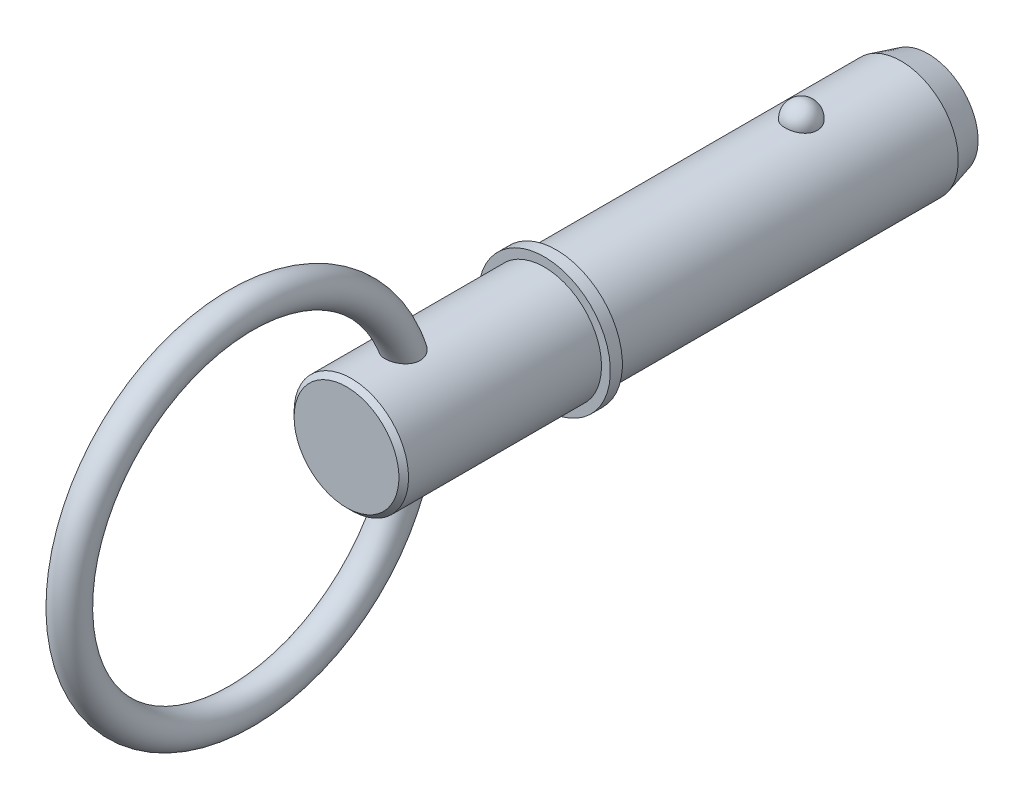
ISO-10303-21;
HEADER;
FILE_DESCRIPTION(('STEP AP214'),'2;1');
FILE_NAME('part.step','',(''),(''),'','','');
FILE_SCHEMA(('AUTOMOTIVE_DESIGN { 1 0 10303 214 1 1 1 1 }'));
ENDSEC;
DATA;
#1=APPLICATION_CONTEXT('core data for automotive mechanical design processes');
#2=APPLICATION_PROTOCOL_DEFINITION('international standard','automotive_design',2000,#1);
#3=PRODUCT_CONTEXT('',#1,'mechanical');
#4=PRODUCT('Part','Part','',(#3));
#5=PRODUCT_RELATED_PRODUCT_CATEGORY('part','',(#4));
#6=PRODUCT_DEFINITION_FORMATION('','',#4);
#7=PRODUCT_DEFINITION_CONTEXT('part definition',#1,'design');
#8=PRODUCT_DEFINITION('design','',#6,#7);
#9=PRODUCT_DEFINITION_SHAPE('','',#8);
#10=(LENGTH_UNIT() NAMED_UNIT(*) SI_UNIT(.MILLI.,.METRE.));
#11=(NAMED_UNIT(*) PLANE_ANGLE_UNIT() SI_UNIT($,.RADIAN.));
#12=(NAMED_UNIT(*) SI_UNIT($,.STERADIAN.) SOLID_ANGLE_UNIT());
#13=UNCERTAINTY_MEASURE_WITH_UNIT(LENGTH_MEASURE(1.E-05),#10,'distance_accuracy_value','');
#14=(GEOMETRIC_REPRESENTATION_CONTEXT(3) GLOBAL_UNCERTAINTY_ASSIGNED_CONTEXT((#13)) GLOBAL_UNIT_ASSIGNED_CONTEXT((#10,
#11,#12)) REPRESENTATION_CONTEXT('',''));
#15=CARTESIAN_POINT('',(0.,0.,0.));
#16=DIRECTION('',(0.,0.,1.));
#17=DIRECTION('',(1.,0.,0.));
#18=AXIS2_PLACEMENT_3D('',#15,#16,#17);
#19=CARTESIAN_POINT('',(0.,0.,38.1));
#20=DIRECTION('',(0.,0.,-1.));
#21=DIRECTION('',(-1.,0.,0.));
#22=AXIS2_PLACEMENT_3D('',#19,#20,#21);
#23=CYLINDRICAL_SURFACE('',#22,9.525);
#24=CARTESIAN_POINT('',(2.66304631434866,9.14515223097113,-2.69));
#25=CARTESIAN_POINT('',(2.66304388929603,9.14515434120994,-2.53964785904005));
#26=CARTESIAN_POINT('',(2.65079171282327,9.14874785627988,-2.389265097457));
#27=CARTESIAN_POINT('',(2.60207590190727,9.16272073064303,-2.09276319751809));
#28=CARTESIAN_POINT('',(2.5656035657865,9.17310252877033,-1.94664561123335));
#29=CARTESIAN_POINT('',(2.469373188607,9.19947238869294,-1.66290124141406));
#30=CARTESIAN_POINT('',(2.40962536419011,9.215457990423,-1.52527076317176));
#31=CARTESIAN_POINT('',(2.26832639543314,9.25124900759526,-1.26225231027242));
#32=CARTESIAN_POINT('',(2.1867756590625,9.27105435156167,-1.1368641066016));
#33=CARTESIAN_POINT('',(2.00344089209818,9.3123948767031,-0.901158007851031));
#34=CARTESIAN_POINT('',(1.90155748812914,9.33393823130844,-0.790918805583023));
#35=CARTESIAN_POINT('',(1.68043702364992,9.37626794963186,-0.589299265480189));
#36=CARTESIAN_POINT('',(1.56119995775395,9.397054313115,-0.497918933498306));
#37=CARTESIAN_POINT('',(1.30893044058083,9.43549335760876,-0.336812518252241));
#38=CARTESIAN_POINT('',(1.17593917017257,9.45315498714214,-0.267024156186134));
#39=CARTESIAN_POINT('',(0.899596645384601,9.48344056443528,-0.150749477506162));
#40=CARTESIAN_POINT('',(0.756246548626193,9.49606507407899,-0.104260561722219));
#41=CARTESIAN_POINT('',(0.466048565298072,9.51468193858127,-0.0365733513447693));
#42=CARTESIAN_POINT('',(0.319312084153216,9.52079100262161,-0.0149294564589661));
#43=CARTESIAN_POINT('',(0.0241592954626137,9.52611235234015,0.00395337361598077));
#44=CARTESIAN_POINT('',(-0.124256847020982,9.5253253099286,0.00119468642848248));
#45=CARTESIAN_POINT('',(-0.416281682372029,9.51700443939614,-0.0284230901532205));
#46=CARTESIAN_POINT('',(-0.559928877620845,9.50956858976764,-0.0549321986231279));
#47=CARTESIAN_POINT('',(-0.840604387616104,9.48887888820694,-0.130816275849));
#48=CARTESIAN_POINT('',(-0.977632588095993,9.47562493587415,-0.180191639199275));
#49=CARTESIAN_POINT('',(-1.24212223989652,9.44460733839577,-0.300803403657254));
#50=CARTESIAN_POINT('',(-1.36952298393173,9.42681774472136,-0.372166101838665));
#51=CARTESIAN_POINT('',(-1.61053183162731,9.38864858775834,-0.53472901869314));
#52=CARTESIAN_POINT('',(-1.72413851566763,9.36826875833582,-0.62593127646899));
#53=CARTESIAN_POINT('',(-1.9367483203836,9.32666137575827,-0.827716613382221));
#54=CARTESIAN_POINT('',(-2.03542624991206,9.3054250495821,-0.938640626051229));
#55=CARTESIAN_POINT('',(-2.21301001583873,9.26480083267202,-1.17562728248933));
#56=CARTESIAN_POINT('',(-2.29191442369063,9.24541307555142,-1.30169101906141));
#57=CARTESIAN_POINT('',(-2.4288038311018,9.21040769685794,-1.56709947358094));
#58=CARTESIAN_POINT('',(-2.48653332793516,9.19483682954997,-1.7065822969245));
#59=CARTESIAN_POINT('',(-2.57830950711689,9.16952722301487,-1.9936348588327));
#60=CARTESIAN_POINT('',(-2.61235688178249,9.1597883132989,-2.14120436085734));
#61=CARTESIAN_POINT('',(-2.65582131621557,9.14728131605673,-2.43957517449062));
#62=CARTESIAN_POINT('',(-2.66534248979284,9.14448376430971,-2.59036007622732));
#63=CARTESIAN_POINT('',(-2.659816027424,9.1460926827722,-2.89143694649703));
#64=CARTESIAN_POINT('',(-2.64476907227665,9.15049895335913,-3.04172892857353));
#65=CARTESIAN_POINT('',(-2.59062526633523,9.16597303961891,-3.33676161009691));
#66=CARTESIAN_POINT('',(-2.55165119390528,9.17700684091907,-3.48152666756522));
#67=CARTESIAN_POINT('',(-2.45072334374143,9.20447158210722,-3.76226728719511));
#68=CARTESIAN_POINT('',(-2.38876863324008,9.22090274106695,-3.89824249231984));
#69=CARTESIAN_POINT('',(-2.24300082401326,9.25744165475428,-4.15838266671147));
#70=CARTESIAN_POINT('',(-2.15906901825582,9.27756919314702,-4.28247834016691));
#71=CARTESIAN_POINT('',(-1.97161008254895,9.31920445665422,-4.51460755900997));
#72=CARTESIAN_POINT('',(-1.86808218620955,9.34071223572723,-4.62264047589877));
#73=CARTESIAN_POINT('',(-1.64365852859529,9.38280712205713,-4.82005417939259));
#74=CARTESIAN_POINT('',(-1.52269814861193,9.40339041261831,-4.90936239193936));
#75=CARTESIAN_POINT('',(-1.26696810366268,9.44124442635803,-5.06628635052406));
#76=CARTESIAN_POINT('',(-1.13219941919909,9.45851538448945,-5.13390363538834));
#77=CARTESIAN_POINT('',(-0.85442700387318,9.48761400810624,-5.24478918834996));
#78=CARTESIAN_POINT('',(-0.711548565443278,9.49950757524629,-5.28835378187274));
#79=CARTESIAN_POINT('',(-0.420167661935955,9.51684639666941,-5.35116010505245));
#80=CARTESIAN_POINT('',(-0.271665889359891,9.52229244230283,-5.3704048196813));
#81=CARTESIAN_POINT('',(0.0236961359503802,9.52609381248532,-5.38387805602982));
#82=CARTESIAN_POINT('',(0.170533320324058,9.52458300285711,-5.37857884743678));
#83=CARTESIAN_POINT('',(0.461166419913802,9.51494050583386,-5.34419624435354));
#84=CARTESIAN_POINT('',(0.604962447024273,9.50680906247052,-5.31511372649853));
#85=CARTESIAN_POINT('',(0.884899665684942,9.48484202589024,-5.23415185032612));
#86=CARTESIAN_POINT('',(1.02106863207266,9.47102889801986,-5.18236222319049));
#87=CARTESIAN_POINT('',(1.28268503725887,9.43915933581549,-5.05742910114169));
#88=CARTESIAN_POINT('',(1.40813178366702,9.421102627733,-4.98428422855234));
#89=CARTESIAN_POINT('',(1.64690915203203,9.38233399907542,-4.81729201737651));
#90=CARTESIAN_POINT('',(1.76002050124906,9.36158508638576,-4.72313982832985));
#91=CARTESIAN_POINT('',(1.96897358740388,9.31987907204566,-4.5173244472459));
#92=CARTESIAN_POINT('',(2.06481234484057,9.29892193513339,-4.40565824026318));
#93=CARTESIAN_POINT('',(2.23837433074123,9.25869342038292,-4.16566572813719));
#94=CARTESIAN_POINT('',(2.31574652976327,9.23945848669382,-4.03707931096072));
#95=CARTESIAN_POINT('',(2.44818540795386,9.20525491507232,-3.76840633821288));
#96=CARTESIAN_POINT('',(2.50325979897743,9.19028480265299,-3.62832377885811));
#97=CARTESIAN_POINT('',(2.58510224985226,9.16757716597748,-3.35610038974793));
#98=CARTESIAN_POINT('',(2.61427951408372,9.15923447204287,-3.22472833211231));
#99=CARTESIAN_POINT('',(2.6532524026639,9.14802112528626,-2.95891229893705));
#100=CARTESIAN_POINT('',(2.66304848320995,9.1451503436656,-2.82446839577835));
#101=CARTESIAN_POINT('',(2.66304631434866,9.14515223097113,-2.69));
#102=B_SPLINE_CURVE_WITH_KNOTS('',3,(#24,#25,#26,#27,#28,#29,#30,#31,#32,#33,#34,#35,#36,#37,
#38,#39,#40,#41,#42,#43,#44,#45,#46,#47,#48,#49,#50,#51,#52,#53,#54,#55,#56,#57,#58,#59,#60,#61,
#62,#63,#64,#65,#66,#67,#68,#69,#70,#71,#72,#73,#74,#75,#76,#77,#78,#79,#80,#81,#82,#83,#84,#85,
#86,#87,#88,#89,#90,#91,#92,#93,#94,#95,#96,#97,#98,#99,#100,#101),.UNSPECIFIED.,.T.,.F.,(4,2,2,
2,2,2,2,2,2,2,2,2,2,2,2,2,2,2,2,2,2,2,2,2,2,2,2,2,2,2,2,2,2,2,2,2,2,2,4),(0.,0.450573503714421,
0.901308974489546,1.35184682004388,1.80237623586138,2.25516399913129,2.70795190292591,
3.15942136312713,3.61084044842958,4.0540301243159,4.49717661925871,4.9338984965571,
5.37062791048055,5.80991423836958,6.24924573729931,6.69708004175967,7.1449466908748,
7.5980522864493,8.0511446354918,8.50231041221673,8.95346368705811,9.40232106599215,
9.85119666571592,10.3025487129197,10.7539184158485,11.2070064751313,11.6600623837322,
12.1074045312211,12.5546917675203,12.9934085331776,13.4321091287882,13.8690915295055,
14.3061021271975,14.7499227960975,15.1938199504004,15.6455814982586,16.0971866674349,
16.5001694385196,16.9031427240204),.UNSPECIFIED.);
#103=CARTESIAN_POINT('',(2.66304631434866,9.14515223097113,-2.69));
#104=VERTEX_POINT('',#103);
#105=EDGE_CURVE('E102',#104,#104,#102,.T.);
#106=ORIENTED_EDGE('',*,*,#105,.T.);
#107=EDGE_LOOP('',(#106));
#108=FACE_BOUND('',#107,.T.);
#109=CARTESIAN_POINT('',(0.,0.,-19.3));
#110=DIRECTION('',(0.,0.,-1.));
#111=DIRECTION('',(-1.,0.,0.));
#112=AXIS2_PLACEMENT_3D('',#109,#110,#111);
#113=CIRCLE('',#112,9.525);
#114=CARTESIAN_POINT('',(-9.525,0.,-19.3));
#115=VERTEX_POINT('',#114);
#116=EDGE_CURVE('E110',#115,#115,#113,.F.);
#117=ORIENTED_EDGE('',*,*,#116,.T.);
#118=EDGE_LOOP('',(#117));
#119=FACE_BOUND('',#118,.T.);
#120=CARTESIAN_POINT('',(0.,0.,38.1));
#121=DIRECTION('',(0.,0.,1.));
#122=DIRECTION('',(1.,0.,0.));
#123=AXIS2_PLACEMENT_3D('',#120,#121,#122);
#124=CIRCLE('',#123,9.525);
#125=CARTESIAN_POINT('',(9.525,0.,38.1));
#126=VERTEX_POINT('',#125);
#127=EDGE_CURVE('E108',#126,#126,#124,.T.);
#128=ORIENTED_EDGE('',*,*,#127,.F.);
#129=EDGE_LOOP('',(#128));
#130=FACE_BOUND('',#129,.T.);
#131=ADVANCED_FACE('F39',(#108,#119,#130),#23,.T.);
#132=CARTESIAN_POINT('',(0.,0.,-23.8));
#133=DIRECTION('',(0.,0.,-1.));
#134=DIRECTION('',(-1.,0.,0.));
#135=AXIS2_PLACEMENT_3D('',#132,#133,#134);
#136=PLANE('',#135);
#137=CARTESIAN_POINT('',(0.,0.,-23.8));
#138=DIRECTION('',(0.,0.,-1.));
#139=DIRECTION('',(-1.,0.,0.));
#140=AXIS2_PLACEMENT_3D('',#137,#138,#139);
#141=CIRCLE('',#140,8.31922863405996);
#142=CARTESIAN_POINT('',(-8.31922863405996,0.,-23.8));
#143=VERTEX_POINT('',#142);
#144=EDGE_CURVE('E142',#143,#143,#141,.T.);
#145=ORIENTED_EDGE('',*,*,#144,.T.);
#146=EDGE_LOOP('',(#145));
#147=FACE_BOUND('',#146,.T.);
#148=ADVANCED_FACE('F88',(#147),#136,.T.);
#149=CARTESIAN_POINT('',(0.,0.,-23.8));
#150=DIRECTION('',(0.,0.,1.));
#151=DIRECTION('',(1.,0.,0.));
#152=AXIS2_PLACEMENT_3D('',#149,#150,#151);
#153=CONICAL_SURFACE('',#152,8.31922863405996,0.261799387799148);
#154=ORIENTED_EDGE('',*,*,#116,.F.);
#155=EDGE_LOOP('',(#154));
#156=FACE_BOUND('',#155,.T.);
#157=ORIENTED_EDGE('',*,*,#144,.F.);
#158=EDGE_LOOP('',(#157));
#159=FACE_BOUND('',#158,.T.);
#160=ADVANCED_FACE('F94',(#156,#159),#153,.T.);
#161=CARTESIAN_POINT('',(0.,9.525,-2.69));
#162=DIRECTION('',(0.,1.,0.));
#163=DIRECTION('',(0.,0.,1.));
#164=AXIS2_PLACEMENT_3D('',#161,#162,#163);
#165=SPHERICAL_SURFACE('',#164,2.69);
#166=ORIENTED_EDGE('',*,*,#105,.F.);
#167=EDGE_LOOP('',(#166));
#168=FACE_BOUND('',#167,.T.);
#169=ADVANCED_FACE('F113',(#168),#165,.T.);
#170=CARTESIAN_POINT('',(0.,0.,38.1));
#171=DIRECTION('',(0.,0.,-1.));
#172=DIRECTION('',(-1.,0.,0.));
#173=AXIS2_PLACEMENT_3D('',#170,#171,#172);
#174=PLANE('',#173);
#175=ORIENTED_EDGE('',*,*,#127,.T.);
#176=EDGE_LOOP('',(#175));
#177=FACE_BOUND('',#176,.T.);
#178=CARTESIAN_POINT('',(0.,0.,38.1));
#179=DIRECTION('',(0.,0.,-1.));
#180=DIRECTION('',(-1.,0.,0.));
#181=AXIS2_PLACEMENT_3D('',#178,#179,#180);
#182=CIRCLE('',#181,11.);
#183=CARTESIAN_POINT('',(-11.,0.,38.1));
#184=VERTEX_POINT('',#183);
#185=EDGE_CURVE('E109',#184,#184,#182,.T.);
#186=ORIENTED_EDGE('',*,*,#185,.T.);
#187=EDGE_LOOP('',(#186));
#188=FACE_BOUND('',#187,.T.);
#189=ADVANCED_FACE('F117',(#177,#188),#174,.T.);
#190=CARTESIAN_POINT('',(0.,0.,33.7287874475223));
#191=DIRECTION('',(0.,0.,-1.));
#192=DIRECTION('',(-1.,0.,0.));
#193=AXIS2_PLACEMENT_3D('',#190,#191,#192);
#194=CYLINDRICAL_SURFACE('',#193,11.);
#195=CARTESIAN_POINT('',(0.,0.,40.1));
#196=DIRECTION('',(0.,0.,-1.));
#197=DIRECTION('',(-1.,0.,0.));
#198=AXIS2_PLACEMENT_3D('',#195,#196,#197);
#199=CIRCLE('',#198,11.);
#200=CARTESIAN_POINT('',(-11.,0.,40.1));
#201=VERTEX_POINT('',#200);
#202=EDGE_CURVE('E134',#201,#201,#199,.T.);
#203=ORIENTED_EDGE('',*,*,#202,.T.);
#204=EDGE_LOOP('',(#203));
#205=FACE_BOUND('',#204,.T.);
#206=ORIENTED_EDGE('',*,*,#185,.F.);
#207=EDGE_LOOP('',(#206));
#208=FACE_BOUND('',#207,.T.);
#209=ADVANCED_FACE('F121',(#205,#208),#194,.T.);
#210=CARTESIAN_POINT('',(0.,11.,40.1));
#211=DIRECTION('',(0.,0.,1.));
#212=DIRECTION('',(1.,0.,0.));
#213=AXIS2_PLACEMENT_3D('',#210,#211,#212);
#214=PLANE('',#213);
#215=CARTESIAN_POINT('',(0.,0.,40.1));
#216=DIRECTION('',(0.,0.,1.));
#217=DIRECTION('',(1.,0.,0.));
#218=AXIS2_PLACEMENT_3D('',#215,#216,#217);
#219=CIRCLE('',#218,9.525);
#220=CARTESIAN_POINT('',(9.525,0.,40.1));
#221=VERTEX_POINT('',#220);
#222=EDGE_CURVE('E112',#221,#221,#219,.T.);
#223=ORIENTED_EDGE('',*,*,#222,.F.);
#224=EDGE_LOOP('',(#223));
#225=FACE_BOUND('',#224,.T.);
#226=ORIENTED_EDGE('',*,*,#202,.F.);
#227=EDGE_LOOP('',(#226));
#228=FACE_BOUND('',#227,.T.);
#229=ADVANCED_FACE('F85',(#225,#228),#214,.T.);
#230=CARTESIAN_POINT('',(0.,0.,73.03));
#231=DIRECTION('',(0.,0.,-1.));
#232=DIRECTION('',(-1.,0.,0.));
#233=AXIS2_PLACEMENT_3D('',#230,#231,#232);
#234=CYLINDRICAL_SURFACE('',#233,9.525);
#235=CARTESIAN_POINT('',(-1.17255022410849,-9.45255262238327,61.0156813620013));
#236=CARTESIAN_POINT('',(-1.03279041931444,-9.46988901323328,60.9520581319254));
#237=CARTESIAN_POINT('',(-0.887457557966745,-9.48474288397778,60.9000360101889));
#238=CARTESIAN_POINT('',(-0.589790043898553,-9.50789357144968,60.8203017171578));
#239=CARTESIAN_POINT('',(-0.437456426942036,-9.51619135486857,60.7925859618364));
#240=CARTESIAN_POINT('',(-0.130095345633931,-9.52535230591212,60.762037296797));
#241=CARTESIAN_POINT('',(0.0249321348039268,-9.52621542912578,60.7592045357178));
#242=CARTESIAN_POINT('',(0.333291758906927,-9.5204161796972,60.778480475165));
#243=CARTESIAN_POINT('',(0.486623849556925,-9.51375357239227,60.8005899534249));
#244=CARTESIAN_POINT('',(0.78732615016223,-9.49360162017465,60.8693091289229));
#245=CARTESIAN_POINT('',(0.934692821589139,-9.48010828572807,60.9159331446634));
#246=CARTESIAN_POINT('',(1.21917062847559,-9.44773819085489,61.032695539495));
#247=CARTESIAN_POINT('',(1.35628163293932,-9.42886136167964,61.1028342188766));
#248=CARTESIAN_POINT('',(1.61597534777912,-9.38783836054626,61.2648586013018));
#249=CARTESIAN_POINT('',(1.73859309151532,-9.36570037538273,61.3566901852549));
#250=CARTESIAN_POINT('',(1.96611924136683,-9.32059424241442,61.5599834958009));
#251=CARTESIAN_POINT('',(2.07103000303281,-9.29762620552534,61.6714426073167));
#252=CARTESIAN_POINT('',(2.25895856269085,-9.25375378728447,61.909567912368));
#253=CARTESIAN_POINT('',(2.34223089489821,-9.23282741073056,62.0360291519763));
#254=CARTESIAN_POINT('',(2.48638570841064,-9.19505802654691,62.3016544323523));
#255=CARTESIAN_POINT('',(2.54727152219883,-9.17821441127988,62.4408165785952));
#256=CARTESIAN_POINT('',(2.64504150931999,-9.15051673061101,62.7264509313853));
#257=CARTESIAN_POINT('',(2.68213620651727,-9.13961026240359,62.87284631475));
#258=CARTESIAN_POINT('',(2.73308631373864,-9.1245038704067,63.1699359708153));
#259=CARTESIAN_POINT('',(2.74693762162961,-9.12030513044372,63.3206309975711));
#260=CARTESIAN_POINT('',(2.75225289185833,-9.11870262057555,63.6282041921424));
#261=CARTESIAN_POINT('',(2.742835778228,-9.12156626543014,63.7850973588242));
#262=CARTESIAN_POINT('',(2.70120500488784,-9.13397864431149,64.0955303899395));
#263=CARTESIAN_POINT('',(2.66898313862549,-9.14352978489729,64.2490690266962));
#264=CARTESIAN_POINT('',(2.57915721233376,-9.1692947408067,64.5643171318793));
#265=CARTESIAN_POINT('',(2.5193838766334,-9.18606757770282,64.7253627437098));
#266=CARTESIAN_POINT('',(2.37615490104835,-9.22415241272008,65.0361129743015));
#267=CARTESIAN_POINT('',(2.29267648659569,-9.2454687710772,65.1858065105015));
#268=CARTESIAN_POINT('',(2.09570343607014,-9.29218719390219,65.4820058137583));
#269=CARTESIAN_POINT('',(1.98029238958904,-9.31778152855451,65.6272155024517));
#270=CARTESIAN_POINT('',(1.72523060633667,-9.36835235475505,65.894631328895));
#271=CARTESIAN_POINT('',(1.58560973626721,-9.39332956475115,66.0168654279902));
#272=CARTESIAN_POINT('',(1.31999418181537,-9.43381163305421,66.206542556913));
#273=CARTESIAN_POINT('',(1.19849876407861,-9.45016352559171,66.2801115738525));
#274=CARTESIAN_POINT('',(0.944726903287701,-9.47889043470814,66.4065550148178));
#275=CARTESIAN_POINT('',(0.812460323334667,-9.4912690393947,66.4594481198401));
#276=CARTESIAN_POINT('',(0.539385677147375,-9.51070487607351,66.5415791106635));
#277=CARTESIAN_POINT('',(0.398529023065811,-9.51772807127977,66.5706657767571));
#278=CARTESIAN_POINT('',(0.1136927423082,-9.52538430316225,66.6023462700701));
#279=CARTESIAN_POINT('',(-0.0302854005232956,-9.52602031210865,66.6049524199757));
#280=CARTESIAN_POINT('',(-0.301067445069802,-9.52110324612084,66.5846387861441));
#281=CARTESIAN_POINT('',(-0.428091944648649,-9.51619084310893,66.5643615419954));
#282=CARTESIAN_POINT('',(-0.67696095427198,-9.50173118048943,66.5037701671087));
#283=CARTESIAN_POINT('',(-0.798804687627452,-9.49218322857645,66.4634530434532));
#284=CARTESIAN_POINT('',(-1.03743276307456,-9.4691126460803,66.3637974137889));
#285=CARTESIAN_POINT('',(-1.15402581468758,-9.45550022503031,66.3040261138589));
#286=CARTESIAN_POINT('',(-1.37707059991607,-9.42560278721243,66.1684655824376));
#287=CARTESIAN_POINT('',(-1.48351822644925,-9.40931669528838,66.0926699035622));
#288=CARTESIAN_POINT('',(-1.70022776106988,-9.37276249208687,65.9152067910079));
#289=CARTESIAN_POINT('',(-1.80866644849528,-9.35226352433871,65.8113639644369));
#290=CARTESIAN_POINT('',(-2.00947431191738,-9.31118474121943,65.5891646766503));
#291=CARTESIAN_POINT('',(-2.10183201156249,-9.29060487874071,65.470797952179));
#292=CARTESIAN_POINT('',(-2.28343646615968,-9.24779116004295,65.2017233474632));
#293=CARTESIAN_POINT('',(-2.36963977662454,-9.22584708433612,65.0489048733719));
#294=CARTESIAN_POINT('',(-2.51731958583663,-9.18665215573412,64.7311082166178));
#295=CARTESIAN_POINT('',(-2.57878214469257,-9.16940395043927,64.5661232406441));
#296=CARTESIAN_POINT('',(-2.67771284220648,-9.14102404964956,64.2179062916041));
#297=CARTESIAN_POINT('',(-2.71355979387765,-9.13031106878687,64.0341717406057));
#298=CARTESIAN_POINT('',(-2.75239325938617,-9.11868499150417,63.6629391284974));
#299=CARTESIAN_POINT('',(-2.75540326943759,-9.11776488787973,63.4754438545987));
#300=CARTESIAN_POINT('',(-2.72755769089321,-9.12612848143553,63.1182334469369));
#301=CARTESIAN_POINT('',(-2.69938579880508,-9.1346036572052,62.9482935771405));
#302=CARTESIAN_POINT('',(-2.6128234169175,-9.15973790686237,62.6169419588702));
#303=CARTESIAN_POINT('',(-2.55445306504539,-9.17639152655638,62.4555246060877));
#304=CARTESIAN_POINT('',(-2.41575064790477,-9.21381352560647,62.1622621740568));
#305=CARTESIAN_POINT('',(-2.33810564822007,-9.23402440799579,62.0290677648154));
#306=CARTESIAN_POINT('',(-2.16110598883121,-9.27704240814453,61.7784363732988));
#307=CARTESIAN_POINT('',(-2.06174995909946,-9.29984968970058,61.66100038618));
#308=CARTESIAN_POINT('',(-1.84046167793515,-9.34620233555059,61.4414448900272));
#309=CARTESIAN_POINT('',(-1.71787459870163,-9.36974632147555,61.3399849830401));
#310=CARTESIAN_POINT('',(-1.45637301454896,-9.41393415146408,61.1600854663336));
#311=CARTESIAN_POINT('',(-1.31745717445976,-9.43457775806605,61.0816477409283));
#312=CARTESIAN_POINT('',(-1.17255022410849,-9.45255262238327,61.0156813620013));
#313=B_SPLINE_CURVE_WITH_KNOTS('',3,(#235,#236,#237,#238,#239,#240,#241,#242,#243,#244,#245,
#246,#247,#248,#249,#250,#251,#252,#253,#254,#255,#256,#257,#258,#259,#260,#261,#262,#263,#264,
#265,#266,#267,#268,#269,#270,#271,#272,#273,#274,#275,#276,#277,#278,#279,#280,#281,#282,#283,
#284,#285,#286,#287,#288,#289,#290,#291,#292,#293,#294,#295,#296,#297,#298,#299,#300,#301,#302,
#303,#304,#305,#306,#307,#308,#309,#310,#311,#312),.UNSPECIFIED.,.T.,.F.,(4,2,2,2,2,2,2,2,2,2,2,
2,2,2,2,2,2,2,2,2,2,2,2,2,2,2,2,2,2,2,2,2,2,2,2,2,2,2,4),(0.,0.463035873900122,0.92600346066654,
1.38897381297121,1.85195860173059,2.31521411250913,2.77847553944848,3.24059321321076,
3.70264936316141,4.1589953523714,4.61527338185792,5.06745604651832,5.5197185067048,
5.98936669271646,6.45918397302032,6.97482863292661,7.49097038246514,8.04995658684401,
8.60825803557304,9.03545685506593,9.46226879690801,9.89177127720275,10.3210738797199,
10.7054535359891,11.0898906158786,11.4835430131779,11.8773540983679,12.3302409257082,
12.7834496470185,13.311649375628,13.8401462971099,14.3996817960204,14.9588168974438,
15.4733264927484,15.9874934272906,16.451669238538,16.915874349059,17.3959238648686,
17.8760126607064),.UNSPECIFIED.);
#314=CARTESIAN_POINT('',(-1.17255022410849,-9.45255262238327,61.0156813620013));
#315=VERTEX_POINT('',#314);
#316=EDGE_CURVE('E10',#315,#315,#313,.T.);
#317=ORIENTED_EDGE('',*,*,#316,.F.);
#318=EDGE_LOOP('',(#317));
#319=FACE_BOUND('',#318,.T.);
#320=CARTESIAN_POINT('',(-1.17255022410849,9.45255262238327,61.0156813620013));
#321=CARTESIAN_POINT('',(-1.31058061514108,9.43543238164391,61.0785143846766));
#322=CARTESIAN_POINT('',(-1.44315063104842,9.41589375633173,61.1526513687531));
#323=CARTESIAN_POINT('',(-1.69365345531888,9.37407591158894,61.3218923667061));
#324=CARTESIAN_POINT('',(-1.81158925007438,9.35179725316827,61.4169920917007));
#325=CARTESIAN_POINT('',(-2.0295663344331,9.30692788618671,61.6259676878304));
#326=CARTESIAN_POINT('',(-2.12959463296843,9.28433696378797,61.7398570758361));
#327=CARTESIAN_POINT('',(-2.30883055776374,9.24139869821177,61.9833457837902));
#328=CARTESIAN_POINT('',(-2.38804080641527,9.22105107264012,62.1129431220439));
#329=CARTESIAN_POINT('',(-2.52289811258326,9.18506690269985,62.3826371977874));
#330=CARTESIAN_POINT('',(-2.57879510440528,9.16938093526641,62.5226025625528));
#331=CARTESIAN_POINT('',(-2.66732862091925,9.14402087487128,62.8101942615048));
#332=CARTESIAN_POINT('',(-2.6999643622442,9.13434698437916,62.9578208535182));
#333=CARTESIAN_POINT('',(-2.74234854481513,9.12171311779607,63.2587097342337));
#334=CARTESIAN_POINT('',(-2.75176419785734,9.11885078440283,63.4120223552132));
#335=CARTESIAN_POINT('',(-2.74768995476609,9.12007747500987,63.718282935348));
#336=CARTESIAN_POINT('',(-2.73419331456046,9.12416854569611,63.8712307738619));
#337=CARTESIAN_POINT('',(-2.6838140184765,9.13911977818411,64.1850489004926));
#338=CARTESIAN_POINT('',(-2.64520186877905,9.15047943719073,64.3456159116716));
#339=CARTESIAN_POINT('',(-2.54485320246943,9.17889121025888,64.6588781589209));
#340=CARTESIAN_POINT('',(-2.48309922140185,9.19594762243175,64.8115673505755));
#341=CARTESIAN_POINT('',(-2.33056913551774,9.23584987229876,65.1211220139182));
#342=CARTESIAN_POINT('',(-2.23745101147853,9.25911216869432,65.2767845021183));
#343=CARTESIAN_POINT('',(-2.02674425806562,9.307501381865,65.5702795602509));
#344=CARTESIAN_POINT('',(-1.90916388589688,9.33262766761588,65.7081181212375));
#345=CARTESIAN_POINT('',(-1.67044606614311,9.37804498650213,65.9420159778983));
#346=CARTESIAN_POINT('',(-1.55243875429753,9.39849934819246,66.0412400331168));
#347=CARTESIAN_POINT('',(-1.30125310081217,9.43654625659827,66.2191930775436));
#348=CARTESIAN_POINT('',(-1.16808326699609,9.45414039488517,66.2979334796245));
#349=CARTESIAN_POINT('',(-0.958516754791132,9.47691412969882,66.397606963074));
#350=CARTESIAN_POINT('',(-0.886649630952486,9.48392776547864,66.4278606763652));
#351=CARTESIAN_POINT('',(-0.740281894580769,9.49647248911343,66.481484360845));
#352=CARTESIAN_POINT('',(-0.665782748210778,9.50200438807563,66.5048580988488));
#353=CARTESIAN_POINT('',(-0.514804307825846,9.51137811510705,66.5442294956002));
#354=CARTESIAN_POINT('',(-0.438326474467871,9.51522115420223,66.560232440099));
#355=CARTESIAN_POINT('',(-0.284116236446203,9.52107513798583,66.5845321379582));
#356=CARTESIAN_POINT('',(-0.206384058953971,9.52308641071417,66.5928302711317));
#357=CARTESIAN_POINT('',(0.00463957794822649,9.5259225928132,66.6045451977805));
#358=CARTESIAN_POINT('',(0.138460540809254,9.52491109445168,66.6003947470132));
#359=CARTESIAN_POINT('',(0.403152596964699,9.51738801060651,66.5692519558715));
#360=CARTESIAN_POINT('',(0.534023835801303,9.51087669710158,66.542260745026));
#361=CARTESIAN_POINT('',(0.783985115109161,9.49347484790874,66.4688065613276));
#362=CARTESIAN_POINT('',(0.903337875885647,9.48277338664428,66.4231810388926));
#363=CARTESIAN_POINT('',(1.13363663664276,9.45800893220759,66.3149289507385));
#364=CARTESIAN_POINT('',(1.24458027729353,9.44394500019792,66.2522976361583));
#365=CARTESIAN_POINT('',(1.46880911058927,9.41182796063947,66.104389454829));
#366=CARTESIAN_POINT('',(1.58087386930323,9.3935013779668,66.0173287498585));
#367=CARTESIAN_POINT('',(1.79132420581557,9.35565274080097,65.8282478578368));
#368=CARTESIAN_POINT('',(1.88970126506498,9.33612995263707,65.7262184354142));
#369=CARTESIAN_POINT('',(2.08778125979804,9.29401761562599,65.4909975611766));
#370=CARTESIAN_POINT('',(2.18473298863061,9.27148591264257,65.35547341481));
#371=CARTESIAN_POINT('',(2.35733954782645,9.22911075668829,65.0710303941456));
#372=CARTESIAN_POINT('',(2.43297838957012,9.2092693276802,64.9221015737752));
#373=CARTESIAN_POINT('',(2.56843139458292,9.17247322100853,64.5972697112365));
#374=CARTESIAN_POINT('',(2.62561924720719,9.15606955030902,64.4201963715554));
#375=CARTESIAN_POINT('',(2.70930664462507,9.13166037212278,64.0583301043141));
#376=CARTESIAN_POINT('',(2.73581406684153,9.12365270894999,63.8735391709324));
#377=CARTESIAN_POINT('',(2.7551261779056,9.11784049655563,63.5090170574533));
#378=CARTESIAN_POINT('',(2.74917791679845,9.11965839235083,63.3293617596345));
#379=CARTESIAN_POINT('',(2.70473277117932,9.13294027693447,62.9744999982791));
#380=CARTESIAN_POINT('',(2.66626406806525,9.14439591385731,62.7992898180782));
#381=CARTESIAN_POINT('',(2.5626384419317,9.17393184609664,62.4784698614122));
#382=CARTESIAN_POINT('',(2.50080069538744,9.19116614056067,62.3317041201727));
#383=CARTESIAN_POINT('',(2.35244847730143,9.23024728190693,62.0518999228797));
#384=CARTESIAN_POINT('',(2.26593972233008,9.25209305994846,61.9188582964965));
#385=CARTESIAN_POINT('',(2.07585352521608,9.29652853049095,61.677145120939));
#386=CARTESIAN_POINT('',(1.97340753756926,9.31901931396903,61.5675620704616));
#387=CARTESIAN_POINT('',(1.7514233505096,9.3632753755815,61.3671794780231));
#388=CARTESIAN_POINT('',(1.6318853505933,9.38504066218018,61.2763797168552));
#389=CARTESIAN_POINT('',(1.3782626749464,9.42563474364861,61.1151683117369));
#390=CARTESIAN_POINT('',(1.24409194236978,9.44444438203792,61.0448873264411));
#391=CARTESIAN_POINT('',(0.965562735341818,9.47697010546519,60.9269968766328));
#392=CARTESIAN_POINT('',(0.821203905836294,9.4906860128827,60.8793882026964));
#393=CARTESIAN_POINT('',(0.524366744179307,9.51173338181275,60.8073692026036));
#394=CARTESIAN_POINT('',(0.371807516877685,9.5189799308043,60.7832670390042));
#395=CARTESIAN_POINT('',(0.0646112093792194,9.52602042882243,60.7598425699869));
#396=CARTESIAN_POINT('',(-0.0900262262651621,9.52581308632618,60.7605245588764));
#397=CARTESIAN_POINT('',(-0.404139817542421,9.51777767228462,60.7872769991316));
#398=CARTESIAN_POINT('',(-0.56350821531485,9.50959696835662,60.8145222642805));
#399=CARTESIAN_POINT('',(-0.874799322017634,9.48602809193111,60.8955333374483));
#400=CARTESIAN_POINT('',(-1.02672214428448,9.47064002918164,60.9492987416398));
#401=CARTESIAN_POINT('',(-1.17255022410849,9.45255262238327,61.0156813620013));
#402=B_SPLINE_CURVE_WITH_KNOTS('',3,(#320,#321,#322,#323,#324,#325,#326,#327,#328,#329,#330,
#331,#332,#333,#334,#335,#336,#337,#338,#339,#340,#341,#342,#343,#344,#345,#346,#347,#348,#349,
#350,#351,#352,#353,#354,#355,#356,#357,#358,#359,#360,#361,#362,#363,#364,#365,#366,#367,#368,
#369,#370,#371,#372,#373,#374,#375,#376,#377,#378,#379,#380,#381,#382,#383,#384,#385,#386,#387,
#388,#389,#390,#391,#392,#393,#394,#395,#396,#397,#398,#399,#400,#401),.UNSPECIFIED.,.T.,.F.,(4,
2,2,2,2,2,2,2,2,2,2,2,2,2,2,2,2,2,2,2,2,2,2,2,2,2,2,2,2,2,2,2,2,2,2,2,2,2,2,2,4),(0.,
0.45730654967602,0.91451962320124,1.372063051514,1.82954881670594,2.28199545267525,
2.73445732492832,3.19336710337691,3.65241198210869,4.14699278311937,4.64194758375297,
5.18812269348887,5.73411374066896,6.19889752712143,6.66342179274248,6.89799214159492,
7.13243382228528,7.36670711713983,7.6009384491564,8.00032434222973,8.39969048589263,
8.78279802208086,9.16601265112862,9.5936670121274,10.0215863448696,10.5240084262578,
11.0268064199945,11.5844522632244,12.1419548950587,12.678191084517,13.2139630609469,
13.6920531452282,14.1700325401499,14.6229745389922,15.0759112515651,15.5316722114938,
15.9874490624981,16.4491237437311,16.9108784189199,17.3940267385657,17.8771677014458),.UNSPECIFIED.);
#403=CARTESIAN_POINT('',(-1.17255022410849,9.45255262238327,61.0156813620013));
#404=VERTEX_POINT('',#403);
#405=EDGE_CURVE('E51',#404,#404,#402,.T.);
#406=ORIENTED_EDGE('',*,*,#405,.F.);
#407=EDGE_LOOP('',(#406));
#408=FACE_BOUND('',#407,.T.);
#409=CARTESIAN_POINT('',(0.,0.,72.23));
#410=DIRECTION('',(0.,0.,-1.));
#411=DIRECTION('',(-1.,0.,0.));
#412=AXIS2_PLACEMENT_3D('',#409,#410,#411);
#413=CIRCLE('',#412,9.525);
#414=CARTESIAN_POINT('',(-9.525,0.,72.23));
#415=VERTEX_POINT('',#414);
#416=EDGE_CURVE('E64',#415,#415,#413,.T.);
#417=ORIENTED_EDGE('',*,*,#416,.T.);
#418=EDGE_LOOP('',(#417));
#419=FACE_BOUND('',#418,.T.);
#420=ORIENTED_EDGE('',*,*,#222,.T.);
#421=EDGE_LOOP('',(#420));
#422=FACE_BOUND('',#421,.T.);
#423=ADVANCED_FACE('F69',(#319,#408,#419,#422),#234,.T.);
#424=CARTESIAN_POINT('',(0.,0.,73.03));
#425=DIRECTION('',(0.,0.,-1.));
#426=DIRECTION('',(-1.,0.,0.));
#427=AXIS2_PLACEMENT_3D('',#424,#425,#426);
#428=PLANE('',#427);
#429=CARTESIAN_POINT('',(0.,0.,73.03));
#430=DIRECTION('',(0.,0.,-1.));
#431=DIRECTION('',(-1.,0.,0.));
#432=AXIS2_PLACEMENT_3D('',#429,#430,#431);
#433=CIRCLE('',#432,8.725);
#434=CARTESIAN_POINT('',(-8.725,0.,73.03));
#435=VERTEX_POINT('',#434);
#436=EDGE_CURVE('E58',#435,#435,#433,.F.);
#437=ORIENTED_EDGE('',*,*,#436,.T.);
#438=EDGE_LOOP('',(#437));
#439=FACE_BOUND('',#438,.T.);
#440=ADVANCED_FACE('F76',(#439),#428,.F.);
#441=CARTESIAN_POINT('',(0.,0.,72.23));
#442=DIRECTION('',(0.,0.,-1.));
#443=DIRECTION('',(-1.,0.,0.));
#444=AXIS2_PLACEMENT_3D('',#441,#442,#443);
#445=CONICAL_SURFACE('',#444,9.525,0.785398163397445);
#446=ORIENTED_EDGE('',*,*,#436,.F.);
#447=EDGE_LOOP('',(#446));
#448=FACE_BOUND('',#447,.T.);
#449=ORIENTED_EDGE('',*,*,#416,.F.);
#450=EDGE_LOOP('',(#449));
#451=FACE_BOUND('',#450,.T.);
#452=ADVANCED_FACE('F41',(#448,#451),#445,.T.);
#453=CARTESIAN_POINT('',(0.,0.,90.605));
#454=DIRECTION('',(1.,0.,0.));
#455=DIRECTION('',(0.,0.,-1.));
#456=AXIS2_PLACEMENT_3D('',#453,#454,#455);
#457=TOROIDAL_SURFACE('',#456,28.575,2.75);
#458=ORIENTED_EDGE('',*,*,#316,.T.);
#459=EDGE_LOOP('',(#458));
#460=FACE_BOUND('',#459,.T.);
#461=ORIENTED_EDGE('',*,*,#405,.T.);
#462=EDGE_LOOP('',(#461));
#463=FACE_BOUND('',#462,.T.);
#464=ADVANCED_FACE('F73',(#460,#463),#457,.T.);
#465=CLOSED_SHELL('',(#131,#148,#160,#169,#189,#209,#229,#423,#440,#452,#464));
#466=MANIFOLD_SOLID_BREP('B2',#465);
#467=ADVANCED_BREP_SHAPE_REPRESENTATION('',(#18,#466),#14);
#468=SHAPE_DEFINITION_REPRESENTATION(#9,#467);
ENDSEC;
END-ISO-10303-21;
